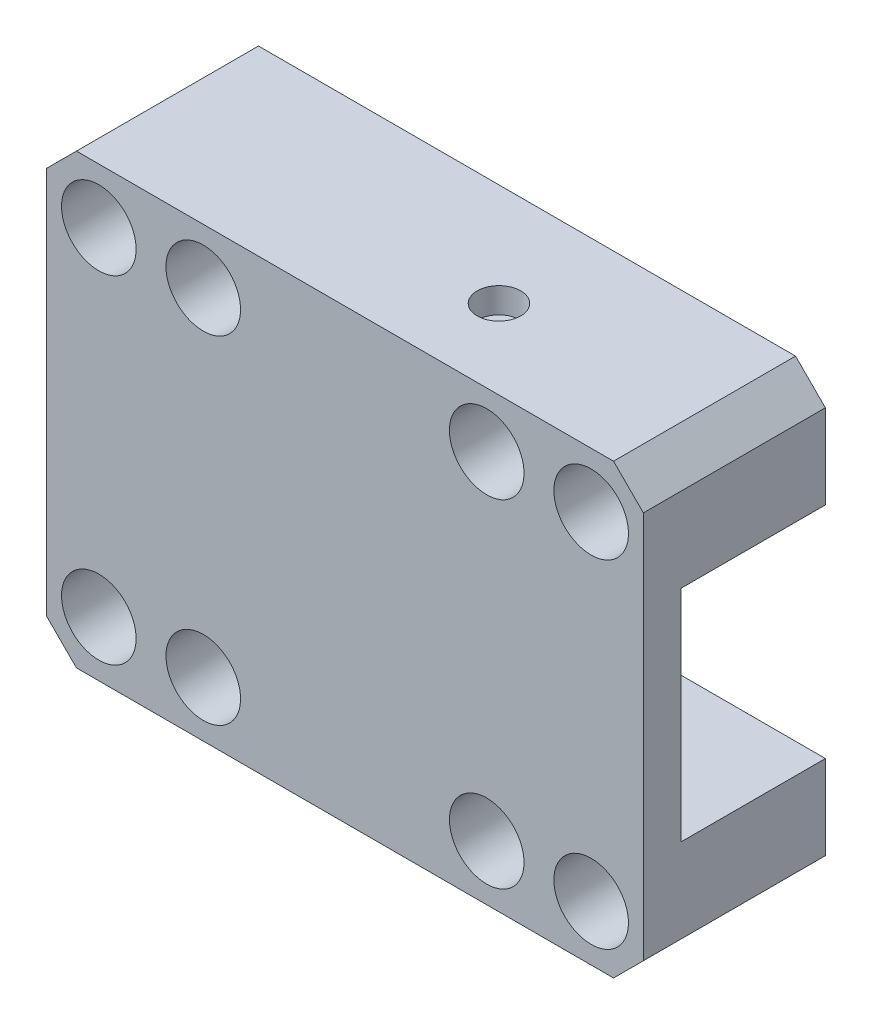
ISO-10303-21;
HEADER;
FILE_DESCRIPTION(('STEP AP214'),'2;1');
FILE_NAME('part.step','',(''),(''),'','','');
FILE_SCHEMA(('AUTOMOTIVE_DESIGN { 1 0 10303 214 1 1 1 1 }'));
ENDSEC;
DATA;
#1=APPLICATION_CONTEXT('core data for automotive mechanical design processes');
#2=APPLICATION_PROTOCOL_DEFINITION('international standard','automotive_design',2000,#1);
#3=PRODUCT_CONTEXT('',#1,'mechanical');
#4=PRODUCT('Part','Part','',(#3));
#5=PRODUCT_RELATED_PRODUCT_CATEGORY('part','',(#4));
#6=PRODUCT_DEFINITION_FORMATION('','',#4);
#7=PRODUCT_DEFINITION_CONTEXT('part definition',#1,'design');
#8=PRODUCT_DEFINITION('design','',#6,#7);
#9=PRODUCT_DEFINITION_SHAPE('','',#8);
#10=(LENGTH_UNIT() NAMED_UNIT(*) SI_UNIT(.MILLI.,.METRE.));
#11=(NAMED_UNIT(*) PLANE_ANGLE_UNIT() SI_UNIT($,.RADIAN.));
#12=(NAMED_UNIT(*) SI_UNIT($,.STERADIAN.) SOLID_ANGLE_UNIT());
#13=UNCERTAINTY_MEASURE_WITH_UNIT(LENGTH_MEASURE(1.E-05),#10,'distance_accuracy_value','');
#14=(GEOMETRIC_REPRESENTATION_CONTEXT(3) GLOBAL_UNCERTAINTY_ASSIGNED_CONTEXT((#13)) GLOBAL_UNIT_ASSIGNED_CONTEXT((#10,
#11,#12)) REPRESENTATION_CONTEXT('',''));
#15=CARTESIAN_POINT('',(0.,0.,0.));
#16=DIRECTION('',(0.,0.,1.));
#17=DIRECTION('',(1.,0.,0.));
#18=AXIS2_PLACEMENT_3D('',#15,#16,#17);
#19=CARTESIAN_POINT('',(21.96,18.3,19.0070999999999));
#20=DIRECTION('',(0.,0.,1.));
#21=DIRECTION('',(1.,0.,0.));
#22=AXIS2_PLACEMENT_3D('',#19,#20,#21);
#23=PLANE('',#22);
#24=DIRECTION('',(1.,0.,0.));
#25=VECTOR('',#24,1.);
#26=CARTESIAN_POINT('',(21.96,8.95279999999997,19.0070999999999));
#27=LINE('',#26,#25);
#28=CARTESIAN_POINT('',(26.7225,8.95279999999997,19.0070999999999));
#29=VERTEX_POINT('',#28);
#30=CARTESIAN_POINT('',(17.1975,8.95279999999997,19.0070999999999));
#31=VERTEX_POINT('',#30);
#32=EDGE_CURVE('E150',#29,#31,#27,.F.);
#33=ORIENTED_EDGE('',*,*,#32,.T.);
#34=DIRECTION('',(0.,1.,0.));
#35=VECTOR('',#34,1.);
#36=CARTESIAN_POINT('',(17.1975,18.3,19.0070999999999));
#37=LINE('',#36,#35);
#38=CARTESIAN_POINT('',(17.1975,27.6472,19.0070999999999));
#39=VERTEX_POINT('',#38);
#40=EDGE_CURVE('E174',#31,#39,#37,.T.);
#41=ORIENTED_EDGE('',*,*,#40,.T.);
#42=DIRECTION('',(1.,0.,0.));
#43=VECTOR('',#42,1.);
#44=CARTESIAN_POINT('',(21.96,27.6472,19.0070999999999));
#45=LINE('',#44,#43);
#46=CARTESIAN_POINT('',(26.7225,27.6472,19.0070999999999));
#47=VERTEX_POINT('',#46);
#48=EDGE_CURVE('E153',#39,#47,#45,.T.);
#49=ORIENTED_EDGE('',*,*,#48,.T.);
#50=DIRECTION('',(0.,1.,0.));
#51=VECTOR('',#50,1.);
#52=CARTESIAN_POINT('',(26.7225,18.3,19.0070999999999));
#53=LINE('',#52,#51);
#54=EDGE_CURVE('E148',#47,#29,#53,.F.);
#55=ORIENTED_EDGE('',*,*,#54,.T.);
#56=EDGE_LOOP('',(#33,#41,#49,#55));
#57=FACE_BOUND('',#56,.T.);
#58=ADVANCED_FACE('F16',(#57),#23,.F.);
#59=CARTESIAN_POINT('',(28.1415518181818,35.191,27.7574));
#60=DIRECTION('',(0.,1.,0.));
#61=DIRECTION('',(0.,0.,1.));
#62=AXIS2_PLACEMENT_3D('',#59,#60,#61);
#63=PLANE('',#62);
#64=CARTESIAN_POINT('',(28.31,35.191,27.7573999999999));
#65=DIRECTION('',(0.,-1.,0.));
#66=DIRECTION('',(0.,0.,-1.));
#67=AXIS2_PLACEMENT_3D('',#64,#65,#66);
#68=CIRCLE('',#67,1.85293);
#69=CARTESIAN_POINT('',(28.31,35.191,25.9044699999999));
#70=VERTEX_POINT('',#69);
#71=EDGE_CURVE('E20',#70,#70,#68,.F.);
#72=ORIENTED_EDGE('',*,*,#71,.T.);
#73=EDGE_LOOP('',(#72));
#74=FACE_BOUND('',#73,.T.);
#75=ADVANCED_FACE('F644',(#74),#63,.T.);
#76=CARTESIAN_POINT('',(26.7225,18.3,25.1665999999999));
#77=DIRECTION('',(-1.,0.,0.));
#78=DIRECTION('',(0.,0.,1.));
#79=AXIS2_PLACEMENT_3D('',#76,#77,#78);
#80=PLANE('',#79);
#81=DIRECTION('',(0.,0.,1.));
#82=VECTOR('',#81,1.);
#83=CARTESIAN_POINT('',(26.7225,8.95279999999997,25.1665999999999));
#84=LINE('',#83,#82);
#85=CARTESIAN_POINT('',(26.7225,8.95279999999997,19.0198));
#86=VERTEX_POINT('',#85);
#87=EDGE_CURVE('E158',#86,#29,#84,.F.);
#88=ORIENTED_EDGE('',*,*,#87,.T.);
#89=ORIENTED_EDGE('',*,*,#54,.F.);
#90=DIRECTION('',(0.,0.,-1.));
#91=VECTOR('',#90,1.);
#92=CARTESIAN_POINT('',(26.7225,27.6472,25.1665999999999));
#93=LINE('',#92,#91);
#94=CARTESIAN_POINT('',(26.7225,27.6472,19.0198));
#95=VERTEX_POINT('',#94);
#96=EDGE_CURVE('E178',#47,#95,#93,.F.);
#97=ORIENTED_EDGE('',*,*,#96,.T.);
#98=DIRECTION('',(0.,0.,-1.));
#99=VECTOR('',#98,1.);
#100=CARTESIAN_POINT('',(26.7225,27.6472,25.1666));
#101=LINE('',#100,#99);
#102=CARTESIAN_POINT('',(26.7225,27.6472,31.3260999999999));
#103=VERTEX_POINT('',#102);
#104=EDGE_CURVE('E188',#103,#95,#101,.T.);
#105=ORIENTED_EDGE('',*,*,#104,.F.);
#106=DIRECTION('',(0.,1.,0.));
#107=VECTOR('',#106,1.);
#108=CARTESIAN_POINT('',(26.7225,18.3,31.3261));
#109=LINE('',#108,#107);
#110=CARTESIAN_POINT('',(26.7225,8.95279999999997,31.3260999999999));
#111=VERTEX_POINT('',#110);
#112=EDGE_CURVE('E184',#111,#103,#109,.T.);
#113=ORIENTED_EDGE('',*,*,#112,.F.);
#114=DIRECTION('',(0.,0.,1.));
#115=VECTOR('',#114,1.);
#116=CARTESIAN_POINT('',(26.7225,8.95279999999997,25.1666));
#117=LINE('',#116,#115);
#118=EDGE_CURVE('E170',#86,#111,#117,.T.);
#119=ORIENTED_EDGE('',*,*,#118,.F.);
#120=EDGE_LOOP('',(#88,#89,#97,#105,#113,#119));
#121=FACE_BOUND('',#120,.T.);
#122=ADVANCED_FACE('F168',(#121),#80,.F.);
#123=CARTESIAN_POINT('',(14.34,2.42499999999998,22.3091));
#124=DIRECTION('',(0.,1.,0.));
#125=DIRECTION('',(0.,0.,1.));
#126=AXIS2_PLACEMENT_3D('',#123,#124,#125);
#127=PLANE('',#126);
#128=CARTESIAN_POINT('',(14.213,2.42499999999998,22.3091));
#129=DIRECTION('',(0.,-1.,0.));
#130=DIRECTION('',(0.,0.,-1.));
#131=AXIS2_PLACEMENT_3D('',#128,#129,#130);
#132=CIRCLE('',#131,1.397);
#133=CARTESIAN_POINT('',(14.213,2.42499999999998,20.9121));
#134=VERTEX_POINT('',#133);
#135=EDGE_CURVE('E193',#134,#134,#132,.T.);
#136=ORIENTED_EDGE('',*,*,#135,.T.);
#137=EDGE_LOOP('',(#136));
#138=FACE_BOUND('',#137,.T.);
#139=ADVANCED_FACE('F350',(#138),#127,.F.);
#140=CARTESIAN_POINT('',(29.58,2.42499999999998,22.3091));
#141=DIRECTION('',(0.,1.,0.));
#142=DIRECTION('',(0.,0.,1.));
#143=AXIS2_PLACEMENT_3D('',#140,#141,#142);
#144=PLANE('',#143);
#145=CARTESIAN_POINT('',(29.707,2.42499999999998,22.3091));
#146=DIRECTION('',(0.,-1.,0.));
#147=DIRECTION('',(0.,0.,-1.));
#148=AXIS2_PLACEMENT_3D('',#145,#146,#147);
#149=CIRCLE('',#148,1.397);
#150=CARTESIAN_POINT('',(29.707,2.42499999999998,20.9121));
#151=VERTEX_POINT('',#150);
#152=EDGE_CURVE('E199',#151,#151,#149,.T.);
#153=ORIENTED_EDGE('',*,*,#152,.T.);
#154=EDGE_LOOP('',(#153));
#155=FACE_BOUND('',#154,.T.);
#156=ADVANCED_FACE('F674',(#155),#144,.F.);
#157=CARTESIAN_POINT('',(21.96,8.95279999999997,25.1665999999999));
#158=DIRECTION('',(0.,1.,0.));
#159=DIRECTION('',(0.,0.,1.));
#160=AXIS2_PLACEMENT_3D('',#157,#158,#159);
#161=PLANE('',#160);
#162=DIRECTION('',(0.,0.,-1.));
#163=VECTOR('',#162,1.);
#164=CARTESIAN_POINT('',(17.1975,8.95279999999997,25.1665999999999));
#165=LINE('',#164,#163);
#166=CARTESIAN_POINT('',(17.1975,8.95279999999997,19.0198));
#167=VERTEX_POINT('',#166);
#168=EDGE_CURVE('E165',#167,#31,#165,.T.);
#169=ORIENTED_EDGE('',*,*,#168,.T.);
#170=ORIENTED_EDGE('',*,*,#32,.F.);
#171=ORIENTED_EDGE('',*,*,#87,.F.);
#172=DIRECTION('',(-1.,0.,0.));
#173=VECTOR('',#172,1.);
#174=CARTESIAN_POINT('',(21.96,8.95279999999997,19.0198));
#175=LINE('',#174,#173);
#176=EDGE_CURVE('E203',#167,#86,#175,.F.);
#177=ORIENTED_EDGE('',*,*,#176,.F.);
#178=EDGE_LOOP('',(#169,#170,#171,#177));
#179=FACE_BOUND('',#178,.T.);
#180=ADVANCED_FACE('F162',(#179),#161,.F.);
#181=CARTESIAN_POINT('',(17.1975,18.3,25.1665999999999));
#182=DIRECTION('',(1.,0.,0.));
#183=DIRECTION('',(0.,0.,-1.));
#184=AXIS2_PLACEMENT_3D('',#181,#182,#183);
#185=PLANE('',#184);
#186=DIRECTION('',(0.,0.,-1.));
#187=VECTOR('',#186,1.);
#188=CARTESIAN_POINT('',(17.1975,27.6472,25.1665999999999));
#189=LINE('',#188,#187);
#190=CARTESIAN_POINT('',(17.1975,27.6472,19.0198));
#191=VERTEX_POINT('',#190);
#192=EDGE_CURVE('E176',#191,#39,#189,.T.);
#193=ORIENTED_EDGE('',*,*,#192,.T.);
#194=ORIENTED_EDGE('',*,*,#40,.F.);
#195=ORIENTED_EDGE('',*,*,#168,.F.);
#196=DIRECTION('',(0.,0.,1.));
#197=VECTOR('',#196,1.);
#198=CARTESIAN_POINT('',(17.1975,8.95279999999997,25.1666));
#199=LINE('',#198,#197);
#200=CARTESIAN_POINT('',(17.1975,8.95279999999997,31.3260999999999));
#201=VERTEX_POINT('',#200);
#202=EDGE_CURVE('E195',#201,#167,#199,.F.);
#203=ORIENTED_EDGE('',*,*,#202,.F.);
#204=DIRECTION('',(0.,1.,0.));
#205=VECTOR('',#204,1.);
#206=CARTESIAN_POINT('',(17.1975,18.3,31.3261));
#207=LINE('',#206,#205);
#208=CARTESIAN_POINT('',(17.1975,27.6472,31.3260999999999));
#209=VERTEX_POINT('',#208);
#210=EDGE_CURVE('E208',#209,#201,#207,.F.);
#211=ORIENTED_EDGE('',*,*,#210,.F.);
#212=DIRECTION('',(0.,0.,-1.));
#213=VECTOR('',#212,1.);
#214=CARTESIAN_POINT('',(17.1975,27.6472,25.1666));
#215=LINE('',#214,#213);
#216=EDGE_CURVE('E202',#191,#209,#215,.F.);
#217=ORIENTED_EDGE('',*,*,#216,.F.);
#218=EDGE_LOOP('',(#193,#194,#195,#203,#211,#217));
#219=FACE_BOUND('',#218,.T.);
#220=ADVANCED_FACE('F408',(#219),#185,.F.);
#221=CARTESIAN_POINT('',(21.96,27.6472,25.1665999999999));
#222=DIRECTION('',(0.,-1.,0.));
#223=DIRECTION('',(0.,0.,-1.));
#224=AXIS2_PLACEMENT_3D('',#221,#222,#223);
#225=PLANE('',#224);
#226=ORIENTED_EDGE('',*,*,#96,.F.);
#227=ORIENTED_EDGE('',*,*,#48,.F.);
#228=ORIENTED_EDGE('',*,*,#192,.F.);
#229=DIRECTION('',(-1.,0.,0.));
#230=VECTOR('',#229,1.);
#231=CARTESIAN_POINT('',(21.96,27.6472,19.0198));
#232=LINE('',#231,#230);
#233=EDGE_CURVE('E219',#95,#191,#232,.T.);
#234=ORIENTED_EDGE('',*,*,#233,.F.);
#235=EDGE_LOOP('',(#226,#227,#228,#234));
#236=FACE_BOUND('',#235,.T.);
#237=ADVANCED_FACE('F411',(#236),#225,.F.);
#238=CARTESIAN_POINT('',(28.31,37.3499999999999,27.7573999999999));
#239=DIRECTION('',(0.,-1.,0.));
#240=DIRECTION('',(0.,0.,-1.));
#241=AXIS2_PLACEMENT_3D('',#238,#239,#240);
#242=CYLINDRICAL_SURFACE('',#241,1.85293);
#243=CARTESIAN_POINT('',(28.31,37.3499999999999,27.7573999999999));
#244=DIRECTION('',(0.,-1.,0.));
#245=DIRECTION('',(0.,0.,-1.));
#246=AXIS2_PLACEMENT_3D('',#243,#244,#245);
#247=CIRCLE('',#246,1.85293);
#248=CARTESIAN_POINT('',(28.31,37.3499999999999,25.9044699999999));
#249=VERTEX_POINT('',#248);
#250=EDGE_CURVE('E225',#249,#249,#247,.T.);
#251=ORIENTED_EDGE('',*,*,#250,.F.);
#252=EDGE_LOOP('',(#251));
#253=FACE_BOUND('',#252,.T.);
#254=ORIENTED_EDGE('',*,*,#71,.F.);
#255=EDGE_LOOP('',(#254));
#256=FACE_BOUND('',#255,.T.);
#257=ADVANCED_FACE('F712',(#253,#256),#242,.F.);
#258=CARTESIAN_POINT('',(21.96,8.95279999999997,25.1666));
#259=DIRECTION('',(0.,1.,0.));
#260=DIRECTION('',(0.,0.,1.));
#261=AXIS2_PLACEMENT_3D('',#258,#259,#260);
#262=PLANE('',#261);
#263=DIRECTION('',(0.,0.,-1.));
#264=VECTOR('',#263,1.);
#265=CARTESIAN_POINT('',(47.36,8.95279999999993,19.0197999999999));
#266=LINE('',#265,#264);
#267=CARTESIAN_POINT('',(47.36,8.95279999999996,19.0198));
#268=VERTEX_POINT('',#267);
#269=CARTESIAN_POINT('',(47.36,8.95279999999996,31.3260999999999));
#270=VERTEX_POINT('',#269);
#271=EDGE_CURVE('E228',#268,#270,#266,.F.);
#272=ORIENTED_EDGE('',*,*,#271,.F.);
#273=DIRECTION('',(-1.,0.,0.));
#274=VECTOR('',#273,1.);
#275=CARTESIAN_POINT('',(21.96,8.95279999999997,19.0198));
#276=LINE('',#275,#274);
#277=EDGE_CURVE('E200',#86,#268,#276,.F.);
#278=ORIENTED_EDGE('',*,*,#277,.F.);
#279=ORIENTED_EDGE('',*,*,#118,.T.);
#280=DIRECTION('',(-1.,0.,0.));
#281=VECTOR('',#280,1.);
#282=CARTESIAN_POINT('',(21.96,8.95279999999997,31.3261));
#283=LINE('',#282,#281);
#284=EDGE_CURVE('E185',#270,#111,#283,.T.);
#285=ORIENTED_EDGE('',*,*,#284,.F.);
#286=EDGE_LOOP('',(#272,#278,#279,#285));
#287=FACE_BOUND('',#286,.T.);
#288=ADVANCED_FACE('F723',(#287),#262,.T.);
#289=CARTESIAN_POINT('',(21.96,18.3,31.3261));
#290=DIRECTION('',(0.,0.,-1.));
#291=DIRECTION('',(-1.,0.,0.));
#292=AXIS2_PLACEMENT_3D('',#289,#290,#291);
#293=PLANE('',#292);
#294=DIRECTION('',(0.,1.,0.));
#295=VECTOR('',#294,1.);
#296=CARTESIAN_POINT('',(47.36,34.8099999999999,31.3261));
#297=LINE('',#296,#295);
#298=CARTESIAN_POINT('',(47.36,27.6472,31.3261));
#299=VERTEX_POINT('',#298);
#300=EDGE_CURVE('E241',#270,#299,#297,.T.);
#301=ORIENTED_EDGE('',*,*,#300,.F.);
#302=ORIENTED_EDGE('',*,*,#284,.T.);
#303=ORIENTED_EDGE('',*,*,#112,.T.);
#304=DIRECTION('',(1.,0.,0.));
#305=VECTOR('',#304,1.);
#306=CARTESIAN_POINT('',(21.96,27.6472,31.3261));
#307=LINE('',#306,#305);
#308=EDGE_CURVE('E190',#299,#103,#307,.F.);
#309=ORIENTED_EDGE('',*,*,#308,.F.);
#310=EDGE_LOOP('',(#301,#302,#303,#309));
#311=FACE_BOUND('',#310,.T.);
#312=ADVANCED_FACE('F735',(#311),#293,.T.);
#313=CARTESIAN_POINT('',(21.96,27.6472,25.1666));
#314=DIRECTION('',(0.,-1.,0.));
#315=DIRECTION('',(0.,0.,-1.));
#316=AXIS2_PLACEMENT_3D('',#313,#314,#315);
#317=PLANE('',#316);
#318=DIRECTION('',(0.,0.,-1.));
#319=VECTOR('',#318,1.);
#320=CARTESIAN_POINT('',(47.36,27.6472,19.0197999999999));
#321=LINE('',#320,#319);
#322=CARTESIAN_POINT('',(47.36,27.6472,19.0198));
#323=VERTEX_POINT('',#322);
#324=EDGE_CURVE('E239',#299,#323,#321,.T.);
#325=ORIENTED_EDGE('',*,*,#324,.F.);
#326=ORIENTED_EDGE('',*,*,#308,.T.);
#327=ORIENTED_EDGE('',*,*,#104,.T.);
#328=DIRECTION('',(-1.,0.,0.));
#329=VECTOR('',#328,1.);
#330=CARTESIAN_POINT('',(21.96,27.6472,19.0198));
#331=LINE('',#330,#329);
#332=EDGE_CURVE('E212',#323,#95,#331,.T.);
#333=ORIENTED_EDGE('',*,*,#332,.F.);
#334=EDGE_LOOP('',(#325,#326,#327,#333));
#335=FACE_BOUND('',#334,.T.);
#336=ADVANCED_FACE('F356',(#335),#317,.T.);
#337=CARTESIAN_POINT('',(14.213,2.42499999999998,22.3091));
#338=DIRECTION('',(0.,-1.,0.));
#339=DIRECTION('',(0.,0.,-1.));
#340=AXIS2_PLACEMENT_3D('',#337,#338,#339);
#341=CYLINDRICAL_SURFACE('',#340,1.397);
#342=ORIENTED_EDGE('',*,*,#135,.F.);
#343=EDGE_LOOP('',(#342));
#344=FACE_BOUND('',#343,.T.);
#345=CARTESIAN_POINT('',(14.213,-0.750000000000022,22.3091));
#346=DIRECTION('',(0.,-1.,0.));
#347=DIRECTION('',(0.,0.,-1.));
#348=AXIS2_PLACEMENT_3D('',#345,#346,#347);
#349=CIRCLE('',#348,1.397);
#350=CARTESIAN_POINT('',(14.213,-0.750000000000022,20.9121));
#351=VERTEX_POINT('',#350);
#352=EDGE_CURVE('E250',#351,#351,#349,.F.);
#353=ORIENTED_EDGE('',*,*,#352,.F.);
#354=EDGE_LOOP('',(#353));
#355=FACE_BOUND('',#354,.T.);
#356=ADVANCED_FACE('F352',(#344,#355),#341,.F.);
#357=CARTESIAN_POINT('',(29.707,2.42499999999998,22.3091));
#358=DIRECTION('',(0.,-1.,0.));
#359=DIRECTION('',(0.,0.,-1.));
#360=AXIS2_PLACEMENT_3D('',#357,#358,#359);
#361=CYLINDRICAL_SURFACE('',#360,1.397);
#362=ORIENTED_EDGE('',*,*,#152,.F.);
#363=EDGE_LOOP('',(#362));
#364=FACE_BOUND('',#363,.T.);
#365=CARTESIAN_POINT('',(29.707,-0.750000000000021,22.3091));
#366=DIRECTION('',(0.,-1.,0.));
#367=DIRECTION('',(0.,0.,-1.));
#368=AXIS2_PLACEMENT_3D('',#365,#366,#367);
#369=CIRCLE('',#368,1.397);
#370=CARTESIAN_POINT('',(29.707,-0.750000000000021,20.9121));
#371=VERTEX_POINT('',#370);
#372=EDGE_CURVE('E257',#371,#371,#369,.F.);
#373=ORIENTED_EDGE('',*,*,#372,.F.);
#374=EDGE_LOOP('',(#373));
#375=FACE_BOUND('',#374,.T.);
#376=ADVANCED_FACE('F355',(#364,#375),#361,.F.);
#377=CARTESIAN_POINT('',(21.96,8.95279999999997,25.1666));
#378=DIRECTION('',(0.,1.,0.));
#379=DIRECTION('',(0.,0.,1.));
#380=AXIS2_PLACEMENT_3D('',#377,#378,#379);
#381=PLANE('',#380);
#382=DIRECTION('',(0.,0.,1.));
#383=VECTOR('',#382,1.);
#384=CARTESIAN_POINT('',(-3.44000000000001,8.95279999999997,19.0198));
#385=LINE('',#384,#383);
#386=CARTESIAN_POINT('',(-3.44000000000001,8.95279999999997,31.3261));
#387=VERTEX_POINT('',#386);
#388=CARTESIAN_POINT('',(-3.44000000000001,8.95279999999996,19.0198));
#389=VERTEX_POINT('',#388);
#390=EDGE_CURVE('E254',#387,#389,#385,.F.);
#391=ORIENTED_EDGE('',*,*,#390,.F.);
#392=DIRECTION('',(-1.,0.,0.));
#393=VECTOR('',#392,1.);
#394=CARTESIAN_POINT('',(21.96,8.95279999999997,31.3261));
#395=LINE('',#394,#393);
#396=EDGE_CURVE('E213',#201,#387,#395,.T.);
#397=ORIENTED_EDGE('',*,*,#396,.F.);
#398=ORIENTED_EDGE('',*,*,#202,.T.);
#399=DIRECTION('',(-1.,0.,0.));
#400=VECTOR('',#399,1.);
#401=CARTESIAN_POINT('',(21.96,8.95279999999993,19.0198));
#402=LINE('',#401,#400);
#403=EDGE_CURVE('E198',#389,#167,#402,.F.);
#404=ORIENTED_EDGE('',*,*,#403,.F.);
#405=EDGE_LOOP('',(#391,#397,#398,#404));
#406=FACE_BOUND('',#405,.T.);
#407=ADVANCED_FACE('F403',(#406),#381,.T.);
#408=CARTESIAN_POINT('',(21.96,18.2999999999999,19.0198));
#409=DIRECTION('',(0.,0.,-1.));
#410=DIRECTION('',(-1.,0.,0.));
#411=AXIS2_PLACEMENT_3D('',#408,#409,#410);
#412=PLANE('',#411);
#413=DIRECTION('',(0.707106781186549,-0.707106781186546,0.));
#414=VECTOR('',#413,1.);
#415=CARTESIAN_POINT('',(-0.900000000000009,-0.750000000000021,19.0198));
#416=LINE('',#415,#414);
#417=CARTESIAN_POINT('',(-3.44000000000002,1.78999999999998,19.0198));
#418=VERTEX_POINT('',#417);
#419=CARTESIAN_POINT('',(-0.900000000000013,-0.75000000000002,19.0198));
#420=VERTEX_POINT('',#419);
#421=EDGE_CURVE('E255',#418,#420,#416,.T.);
#422=ORIENTED_EDGE('',*,*,#421,.F.);
#423=DIRECTION('',(0.,1.,0.));
#424=VECTOR('',#423,1.);
#425=CARTESIAN_POINT('',(-3.44000000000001,1.78999999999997,19.0198));
#426=LINE('',#425,#424);
#427=EDGE_CURVE('E269',#389,#418,#426,.F.);
#428=ORIENTED_EDGE('',*,*,#427,.F.);
#429=ORIENTED_EDGE('',*,*,#403,.T.);
#430=ORIENTED_EDGE('',*,*,#176,.T.);
#431=ORIENTED_EDGE('',*,*,#277,.T.);
#432=DIRECTION('',(0.,1.,0.));
#433=VECTOR('',#432,1.);
#434=CARTESIAN_POINT('',(47.36,34.8099999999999,19.0198));
#435=LINE('',#434,#433);
#436=CARTESIAN_POINT('',(47.36,1.78999999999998,19.0198));
#437=VERTEX_POINT('',#436);
#438=EDGE_CURVE('E231',#437,#268,#435,.T.);
#439=ORIENTED_EDGE('',*,*,#438,.F.);
#440=DIRECTION('',(0.707106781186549,0.707106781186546,0.));
#441=VECTOR('',#440,1.);
#442=CARTESIAN_POINT('',(47.36,1.78999999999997,19.0198));
#443=LINE('',#442,#441);
#444=CARTESIAN_POINT('',(44.82,-0.75000000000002,19.0198));
#445=VERTEX_POINT('',#444);
#446=EDGE_CURVE('E234',#445,#437,#443,.T.);
#447=ORIENTED_EDGE('',*,*,#446,.F.);
#448=DIRECTION('',(1.,0.,0.));
#449=VECTOR('',#448,1.);
#450=CARTESIAN_POINT('',(44.82,-0.750000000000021,19.0198));
#451=LINE('',#450,#449);
#452=EDGE_CURVE('E246',#420,#445,#451,.T.);
#453=ORIENTED_EDGE('',*,*,#452,.F.);
#454=EDGE_LOOP('',(#422,#428,#429,#430,#431,#439,#447,#453));
#455=FACE_BOUND('',#454,.T.);
#456=ADVANCED_FACE('F375',(#455),#412,.T.);
#457=CARTESIAN_POINT('',(21.96,27.6472,25.1666));
#458=DIRECTION('',(0.,-1.,0.));
#459=DIRECTION('',(0.,0.,-1.));
#460=AXIS2_PLACEMENT_3D('',#457,#458,#459);
#461=PLANE('',#460);
#462=DIRECTION('',(0.,0.,1.));
#463=VECTOR('',#462,1.);
#464=CARTESIAN_POINT('',(-3.44000000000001,27.6472,19.0198));
#465=LINE('',#464,#463);
#466=CARTESIAN_POINT('',(-3.44000000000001,27.6472,19.0197999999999));
#467=VERTEX_POINT('',#466);
#468=CARTESIAN_POINT('',(-3.44000000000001,27.6472,31.3260999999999));
#469=VERTEX_POINT('',#468);
#470=EDGE_CURVE('E262',#467,#469,#465,.T.);
#471=ORIENTED_EDGE('',*,*,#470,.F.);
#472=DIRECTION('',(-1.,0.,0.));
#473=VECTOR('',#472,1.);
#474=CARTESIAN_POINT('',(21.96,27.6472,19.0198));
#475=LINE('',#474,#473);
#476=EDGE_CURVE('E216',#191,#467,#475,.T.);
#477=ORIENTED_EDGE('',*,*,#476,.F.);
#478=ORIENTED_EDGE('',*,*,#216,.T.);
#479=DIRECTION('',(-1.,0.,0.));
#480=VECTOR('',#479,1.);
#481=CARTESIAN_POINT('',(21.96,27.6472,31.3261));
#482=LINE('',#481,#480);
#483=EDGE_CURVE('E209',#469,#209,#482,.F.);
#484=ORIENTED_EDGE('',*,*,#483,.F.);
#485=EDGE_LOOP('',(#471,#477,#478,#484));
#486=FACE_BOUND('',#485,.T.);
#487=ADVANCED_FACE('F424',(#486),#461,.T.);
#488=CARTESIAN_POINT('',(21.96,18.3,31.3261));
#489=DIRECTION('',(0.,0.,-1.));
#490=DIRECTION('',(-1.,0.,0.));
#491=AXIS2_PLACEMENT_3D('',#488,#489,#490);
#492=PLANE('',#491);
#493=DIRECTION('',(0.,1.,0.));
#494=VECTOR('',#493,1.);
#495=CARTESIAN_POINT('',(-3.44000000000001,1.78999999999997,31.3261));
#496=LINE('',#495,#494);
#497=EDGE_CURVE('E258',#469,#387,#496,.F.);
#498=ORIENTED_EDGE('',*,*,#497,.F.);
#499=ORIENTED_EDGE('',*,*,#483,.T.);
#500=ORIENTED_EDGE('',*,*,#210,.T.);
#501=ORIENTED_EDGE('',*,*,#396,.T.);
#502=EDGE_LOOP('',(#498,#499,#500,#501));
#503=FACE_BOUND('',#502,.T.);
#504=ADVANCED_FACE('F427',(#503),#492,.T.);
#505=CARTESIAN_POINT('',(21.96,18.2999999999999,19.0198));
#506=DIRECTION('',(0.,0.,-1.));
#507=DIRECTION('',(-1.,0.,0.));
#508=AXIS2_PLACEMENT_3D('',#505,#506,#507);
#509=PLANE('',#508);
#510=DIRECTION('',(-0.707106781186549,0.707106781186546,0.));
#511=VECTOR('',#510,1.);
#512=CARTESIAN_POINT('',(44.82,37.35,19.0197999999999));
#513=LINE('',#512,#511);
#514=CARTESIAN_POINT('',(47.36,34.81,19.0197999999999));
#515=VERTEX_POINT('',#514);
#516=CARTESIAN_POINT('',(44.82,37.35,19.0197999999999));
#517=VERTEX_POINT('',#516);
#518=EDGE_CURVE('E229',#515,#517,#513,.T.);
#519=ORIENTED_EDGE('',*,*,#518,.F.);
#520=DIRECTION('',(0.,1.,0.));
#521=VECTOR('',#520,1.);
#522=CARTESIAN_POINT('',(47.36,34.8099999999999,19.0198));
#523=LINE('',#522,#521);
#524=EDGE_CURVE('E237',#323,#515,#523,.T.);
#525=ORIENTED_EDGE('',*,*,#524,.F.);
#526=ORIENTED_EDGE('',*,*,#332,.T.);
#527=ORIENTED_EDGE('',*,*,#233,.T.);
#528=ORIENTED_EDGE('',*,*,#476,.T.);
#529=DIRECTION('',(0.,1.,0.));
#530=VECTOR('',#529,1.);
#531=CARTESIAN_POINT('',(-3.44000000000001,1.78999999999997,19.0197999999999));
#532=LINE('',#531,#530);
#533=CARTESIAN_POINT('',(-3.44000000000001,34.81,19.0197999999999));
#534=VERTEX_POINT('',#533);
#535=EDGE_CURVE('E264',#534,#467,#532,.F.);
#536=ORIENTED_EDGE('',*,*,#535,.F.);
#537=DIRECTION('',(-0.707106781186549,-0.707106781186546,0.));
#538=VECTOR('',#537,1.);
#539=CARTESIAN_POINT('',(-3.44000000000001,34.8099999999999,19.0198));
#540=LINE('',#539,#538);
#541=CARTESIAN_POINT('',(-0.900000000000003,37.35,19.0198));
#542=VERTEX_POINT('',#541);
#543=EDGE_CURVE('E65',#542,#534,#540,.T.);
#544=ORIENTED_EDGE('',*,*,#543,.F.);
#545=DIRECTION('',(1.,0.,0.));
#546=VECTOR('',#545,1.);
#547=CARTESIAN_POINT('',(-0.900000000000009,37.35,19.0198));
#548=LINE('',#547,#546);
#549=EDGE_CURVE('E218',#517,#542,#548,.F.);
#550=ORIENTED_EDGE('',*,*,#549,.F.);
#551=EDGE_LOOP('',(#519,#525,#526,#527,#528,#536,#544,#550));
#552=FACE_BOUND('',#551,.T.);
#553=ADVANCED_FACE('F419',(#552),#509,.T.);
#554=CARTESIAN_POINT('',(9.60636363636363,3.94899999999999,29.4338));
#555=DIRECTION('',(0.,0.,-1.));
#556=DIRECTION('',(-1.,0.,0.));
#557=AXIS2_PLACEMENT_3D('',#554,#555,#556);
#558=PLANE('',#557);
#559=CARTESIAN_POINT('',(9.895,3.94899999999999,29.4338));
#560=DIRECTION('',(0.,0.,-1.));
#561=DIRECTION('',(0.,1.,0.));
#562=AXIS2_PLACEMENT_3D('',#559,#560,#561);
#563=CIRCLE('',#562,3.175);
#564=CARTESIAN_POINT('',(9.895,7.124,29.4338));
#565=VERTEX_POINT('',#564);
#566=EDGE_CURVE('E273',#565,#565,#563,.F.);
#567=ORIENTED_EDGE('',*,*,#566,.T.);
#568=EDGE_LOOP('',(#567));
#569=FACE_BOUND('',#568,.T.);
#570=ADVANCED_FACE('F435',(#569),#558,.F.);
#571=CARTESIAN_POINT('',(42.6263636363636,3.94899999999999,29.4338));
#572=DIRECTION('',(0.,0.,-1.));
#573=DIRECTION('',(-1.,0.,0.));
#574=AXIS2_PLACEMENT_3D('',#571,#572,#573);
#575=PLANE('',#574);
#576=CARTESIAN_POINT('',(42.915,3.94899999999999,29.4338));
#577=DIRECTION('',(0.,0.,-1.));
#578=DIRECTION('',(0.,1.,0.));
#579=AXIS2_PLACEMENT_3D('',#576,#577,#578);
#580=CIRCLE('',#579,3.175);
#581=CARTESIAN_POINT('',(42.915,7.12399999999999,29.4338));
#582=VERTEX_POINT('',#581);
#583=EDGE_CURVE('E335',#582,#582,#580,.F.);
#584=ORIENTED_EDGE('',*,*,#583,.T.);
#585=EDGE_LOOP('',(#584));
#586=FACE_BOUND('',#585,.T.);
#587=ADVANCED_FACE('F797',(#586),#575,.F.);
#588=CARTESIAN_POINT('',(42.6263636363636,32.651,29.4338));
#589=DIRECTION('',(0.,0.,-1.));
#590=DIRECTION('',(-1.,0.,0.));
#591=AXIS2_PLACEMENT_3D('',#588,#589,#590);
#592=PLANE('',#591);
#593=CARTESIAN_POINT('',(42.915,32.651,29.4338));
#594=DIRECTION('',(0.,0.,-1.));
#595=DIRECTION('',(-1.,0.,0.));
#596=AXIS2_PLACEMENT_3D('',#593,#594,#595);
#597=CIRCLE('',#596,3.175);
#598=CARTESIAN_POINT('',(39.74,32.651,29.4338));
#599=VERTEX_POINT('',#598);
#600=EDGE_CURVE('E332',#599,#599,#597,.F.);
#601=ORIENTED_EDGE('',*,*,#600,.T.);
#602=EDGE_LOOP('',(#601));
#603=FACE_BOUND('',#602,.T.);
#604=ADVANCED_FACE('F809',(#603),#592,.F.);
#605=CARTESIAN_POINT('',(0.716363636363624,32.651,29.4338));
#606=DIRECTION('',(0.,0.,-1.));
#607=DIRECTION('',(-1.,0.,0.));
#608=AXIS2_PLACEMENT_3D('',#605,#606,#607);
#609=PLANE('',#608);
#610=CARTESIAN_POINT('',(1.005,32.651,29.4338));
#611=DIRECTION('',(0.,0.,-1.));
#612=DIRECTION('',(-1.,0.,0.));
#613=AXIS2_PLACEMENT_3D('',#610,#611,#612);
#614=CIRCLE('',#613,3.175);
#615=CARTESIAN_POINT('',(-2.17000000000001,32.651,29.4338));
#616=VERTEX_POINT('',#615);
#617=EDGE_CURVE('E329',#616,#616,#614,.F.);
#618=ORIENTED_EDGE('',*,*,#617,.T.);
#619=EDGE_LOOP('',(#618));
#620=FACE_BOUND('',#619,.T.);
#621=ADVANCED_FACE('F820',(#620),#609,.F.);
#622=CARTESIAN_POINT('',(9.60636363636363,32.651,29.4338));
#623=DIRECTION('',(0.,0.,-1.));
#624=DIRECTION('',(-1.,0.,0.));
#625=AXIS2_PLACEMENT_3D('',#622,#623,#624);
#626=PLANE('',#625);
#627=CARTESIAN_POINT('',(9.895,32.651,29.4338));
#628=DIRECTION('',(0.,0.,-1.));
#629=DIRECTION('',(-1.,0.,0.));
#630=AXIS2_PLACEMENT_3D('',#627,#628,#629);
#631=CIRCLE('',#630,3.175);
#632=CARTESIAN_POINT('',(6.72,32.651,29.4338));
#633=VERTEX_POINT('',#632);
#634=EDGE_CURVE('E326',#633,#633,#631,.F.);
#635=ORIENTED_EDGE('',*,*,#634,.T.);
#636=EDGE_LOOP('',(#635));
#637=FACE_BOUND('',#636,.T.);
#638=ADVANCED_FACE('F515',(#637),#626,.F.);
#639=CARTESIAN_POINT('',(33.7363636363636,32.651,29.4338));
#640=DIRECTION('',(0.,0.,-1.));
#641=DIRECTION('',(-1.,0.,0.));
#642=AXIS2_PLACEMENT_3D('',#639,#640,#641);
#643=PLANE('',#642);
#644=CARTESIAN_POINT('',(34.025,32.651,29.4338));
#645=DIRECTION('',(0.,0.,-1.));
#646=DIRECTION('',(-1.,0.,0.));
#647=AXIS2_PLACEMENT_3D('',#644,#645,#646);
#648=CIRCLE('',#647,3.175);
#649=CARTESIAN_POINT('',(30.85,32.651,29.4338));
#650=VERTEX_POINT('',#649);
#651=EDGE_CURVE('E323',#650,#650,#648,.F.);
#652=ORIENTED_EDGE('',*,*,#651,.T.);
#653=EDGE_LOOP('',(#652));
#654=FACE_BOUND('',#653,.T.);
#655=ADVANCED_FACE('F507',(#654),#643,.F.);
#656=CARTESIAN_POINT('',(33.7363636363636,3.94899999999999,29.4338));
#657=DIRECTION('',(0.,0.,-1.));
#658=DIRECTION('',(-1.,0.,0.));
#659=AXIS2_PLACEMENT_3D('',#656,#657,#658);
#660=PLANE('',#659);
#661=CARTESIAN_POINT('',(34.025,3.94899999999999,29.4338));
#662=DIRECTION('',(0.,0.,-1.));
#663=DIRECTION('',(0.,1.,0.));
#664=AXIS2_PLACEMENT_3D('',#661,#662,#663);
#665=CIRCLE('',#664,3.175);
#666=CARTESIAN_POINT('',(34.025,7.124,29.4338));
#667=VERTEX_POINT('',#666);
#668=EDGE_CURVE('E297',#667,#667,#665,.F.);
#669=ORIENTED_EDGE('',*,*,#668,.T.);
#670=EDGE_LOOP('',(#669));
#671=FACE_BOUND('',#670,.T.);
#672=ADVANCED_FACE('F505',(#671),#660,.F.);
#673=CARTESIAN_POINT('',(-0.900000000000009,37.35,19.0198));
#674=DIRECTION('',(0.,1.,0.));
#675=DIRECTION('',(0.,0.,1.));
#676=AXIS2_PLACEMENT_3D('',#673,#674,#675);
#677=PLANE('',#676);
#678=ORIENTED_EDGE('',*,*,#250,.T.);
#679=EDGE_LOOP('',(#678));
#680=FACE_BOUND('',#679,.T.);
#681=ORIENTED_EDGE('',*,*,#549,.T.);
#682=DIRECTION('',(0.,0.,1.));
#683=VECTOR('',#682,1.);
#684=CARTESIAN_POINT('',(-0.899999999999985,37.35,19.0197999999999));
#685=LINE('',#684,#683);
#686=CARTESIAN_POINT('',(-0.900000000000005,37.35,34.5138));
#687=VERTEX_POINT('',#686);
#688=EDGE_CURVE('E261',#687,#542,#685,.F.);
#689=ORIENTED_EDGE('',*,*,#688,.F.);
#690=DIRECTION('',(-1.,0.,0.));
#691=VECTOR('',#690,1.);
#692=CARTESIAN_POINT('',(21.96,37.35,34.5137999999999));
#693=LINE('',#692,#691);
#694=CARTESIAN_POINT('',(44.82,37.35,34.5138));
#695=VERTEX_POINT('',#694);
#696=EDGE_CURVE('E60',#687,#695,#693,.F.);
#697=ORIENTED_EDGE('',*,*,#696,.T.);
#698=DIRECTION('',(0.,0.,1.));
#699=VECTOR('',#698,1.);
#700=CARTESIAN_POINT('',(44.82,37.35,19.0198));
#701=LINE('',#700,#699);
#702=EDGE_CURVE('E226',#517,#695,#701,.T.);
#703=ORIENTED_EDGE('',*,*,#702,.F.);
#704=EDGE_LOOP('',(#681,#689,#697,#703));
#705=FACE_BOUND('',#704,.T.);
#706=ADVANCED_FACE('F393',(#680,#705),#677,.T.);
#707=CARTESIAN_POINT('',(44.82,37.35,19.0198));
#708=DIRECTION('',(0.707106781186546,0.707106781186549,0.));
#709=DIRECTION('',(-0.707106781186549,0.707106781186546,0.));
#710=AXIS2_PLACEMENT_3D('',#707,#708,#709);
#711=PLANE('',#710);
#712=ORIENTED_EDGE('',*,*,#518,.T.);
#713=ORIENTED_EDGE('',*,*,#702,.T.);
#714=DIRECTION('',(0.707106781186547,-0.707106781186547,0.));
#715=VECTOR('',#714,1.);
#716=CARTESIAN_POINT('',(44.82,37.35,34.5137999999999));
#717=LINE('',#716,#715);
#718=CARTESIAN_POINT('',(47.36,34.81,34.5138));
#719=VERTEX_POINT('',#718);
#720=EDGE_CURVE('E294',#695,#719,#717,.T.);
#721=ORIENTED_EDGE('',*,*,#720,.T.);
#722=DIRECTION('',(0.,0.,-1.));
#723=VECTOR('',#722,1.);
#724=CARTESIAN_POINT('',(47.36,34.8099999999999,19.0197999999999));
#725=LINE('',#724,#723);
#726=EDGE_CURVE('E235',#515,#719,#725,.F.);
#727=ORIENTED_EDGE('',*,*,#726,.F.);
#728=EDGE_LOOP('',(#712,#713,#721,#727));
#729=FACE_BOUND('',#728,.T.);
#730=ADVANCED_FACE('F389',(#729),#711,.T.);
#731=CARTESIAN_POINT('',(47.36,34.8099999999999,19.0197999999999));
#732=DIRECTION('',(1.,0.,0.));
#733=DIRECTION('',(0.,0.,-1.));
#734=AXIS2_PLACEMENT_3D('',#731,#732,#733);
#735=PLANE('',#734);
#736=DIRECTION('',(0.,0.,1.));
#737=VECTOR('',#736,1.);
#738=CARTESIAN_POINT('',(47.36,1.78999999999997,19.0198));
#739=LINE('',#738,#737);
#740=CARTESIAN_POINT('',(47.36,1.79,34.5138));
#741=VERTEX_POINT('',#740);
#742=EDGE_CURVE('E244',#437,#741,#739,.T.);
#743=ORIENTED_EDGE('',*,*,#742,.F.);
#744=ORIENTED_EDGE('',*,*,#438,.T.);
#745=ORIENTED_EDGE('',*,*,#271,.T.);
#746=ORIENTED_EDGE('',*,*,#300,.T.);
#747=ORIENTED_EDGE('',*,*,#324,.T.);
#748=ORIENTED_EDGE('',*,*,#524,.T.);
#749=ORIENTED_EDGE('',*,*,#726,.T.);
#750=DIRECTION('',(0.,1.,0.));
#751=VECTOR('',#750,1.);
#752=CARTESIAN_POINT('',(47.36,18.3,34.5137999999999));
#753=LINE('',#752,#751);
#754=EDGE_CURVE('E291',#719,#741,#753,.F.);
#755=ORIENTED_EDGE('',*,*,#754,.T.);
#756=EDGE_LOOP('',(#743,#744,#745,#746,#747,#748,#749,#755));
#757=FACE_BOUND('',#756,.T.);
#758=ADVANCED_FACE('F384',(#757),#735,.T.);
#759=CARTESIAN_POINT('',(47.36,1.78999999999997,19.0198));
#760=DIRECTION('',(0.707106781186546,-0.707106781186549,0.));
#761=DIRECTION('',(0.707106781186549,0.707106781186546,0.));
#762=AXIS2_PLACEMENT_3D('',#759,#760,#761);
#763=PLANE('',#762);
#764=ORIENTED_EDGE('',*,*,#446,.T.);
#765=ORIENTED_EDGE('',*,*,#742,.T.);
#766=DIRECTION('',(-0.707106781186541,-0.707106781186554,0.));
#767=VECTOR('',#766,1.);
#768=CARTESIAN_POINT('',(47.36,1.79000000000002,34.5137999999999));
#769=LINE('',#768,#767);
#770=CARTESIAN_POINT('',(44.82,-0.75000000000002,34.5138));
#771=VERTEX_POINT('',#770);
#772=EDGE_CURVE('E288',#741,#771,#769,.T.);
#773=ORIENTED_EDGE('',*,*,#772,.T.);
#774=DIRECTION('',(0.,0.,-1.));
#775=VECTOR('',#774,1.);
#776=CARTESIAN_POINT('',(44.82,-0.750000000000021,19.0198));
#777=LINE('',#776,#775);
#778=EDGE_CURVE('E248',#445,#771,#777,.F.);
#779=ORIENTED_EDGE('',*,*,#778,.F.);
#780=EDGE_LOOP('',(#764,#765,#773,#779));
#781=FACE_BOUND('',#780,.T.);
#782=ADVANCED_FACE('F364',(#781),#763,.T.);
#783=CARTESIAN_POINT('',(44.82,-0.750000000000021,19.0198));
#784=DIRECTION('',(0.,-1.,0.));
#785=DIRECTION('',(0.,0.,-1.));
#786=AXIS2_PLACEMENT_3D('',#783,#784,#785);
#787=PLANE('',#786);
#788=ORIENTED_EDGE('',*,*,#372,.T.);
#789=EDGE_LOOP('',(#788));
#790=FACE_BOUND('',#789,.T.);
#791=ORIENTED_EDGE('',*,*,#352,.T.);
#792=EDGE_LOOP('',(#791));
#793=FACE_BOUND('',#792,.T.);
#794=ORIENTED_EDGE('',*,*,#452,.T.);
#795=ORIENTED_EDGE('',*,*,#778,.T.);
#796=DIRECTION('',(-1.,0.,0.));
#797=VECTOR('',#796,1.);
#798=CARTESIAN_POINT('',(21.96,-0.750000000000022,34.5137999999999));
#799=LINE('',#798,#797);
#800=CARTESIAN_POINT('',(-0.900000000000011,-0.750000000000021,34.5137999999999));
#801=VERTEX_POINT('',#800);
#802=EDGE_CURVE('E285',#771,#801,#799,.T.);
#803=ORIENTED_EDGE('',*,*,#802,.T.);
#804=DIRECTION('',(0.,0.,1.));
#805=VECTOR('',#804,1.);
#806=CARTESIAN_POINT('',(-0.900000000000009,-0.750000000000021,19.0198));
#807=LINE('',#806,#805);
#808=EDGE_CURVE('E252',#420,#801,#807,.T.);
#809=ORIENTED_EDGE('',*,*,#808,.F.);
#810=EDGE_LOOP('',(#794,#795,#803,#809));
#811=FACE_BOUND('',#810,.T.);
#812=ADVANCED_FACE('F360',(#790,#793,#811),#787,.T.);
#813=CARTESIAN_POINT('',(-0.900000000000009,-0.750000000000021,19.0198));
#814=DIRECTION('',(-0.707106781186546,-0.707106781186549,0.));
#815=DIRECTION('',(0.707106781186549,-0.707106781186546,0.));
#816=AXIS2_PLACEMENT_3D('',#813,#814,#815);
#817=PLANE('',#816);
#818=ORIENTED_EDGE('',*,*,#421,.T.);
#819=ORIENTED_EDGE('',*,*,#808,.T.);
#820=DIRECTION('',(-0.707106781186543,0.707106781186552,0.));
#821=VECTOR('',#820,1.);
#822=CARTESIAN_POINT('',(-0.900000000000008,-0.750000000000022,34.5137999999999));
#823=LINE('',#822,#821);
#824=CARTESIAN_POINT('',(-3.44000000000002,1.78999999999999,34.5138));
#825=VERTEX_POINT('',#824);
#826=EDGE_CURVE('E282',#801,#825,#823,.T.);
#827=ORIENTED_EDGE('',*,*,#826,.T.);
#828=DIRECTION('',(0.,0.,1.));
#829=VECTOR('',#828,1.);
#830=CARTESIAN_POINT('',(-3.44000000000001,1.78999999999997,19.0198));
#831=LINE('',#830,#829);
#832=EDGE_CURVE('E267',#418,#825,#831,.T.);
#833=ORIENTED_EDGE('',*,*,#832,.F.);
#834=EDGE_LOOP('',(#818,#819,#827,#833));
#835=FACE_BOUND('',#834,.T.);
#836=ADVANCED_FACE('F363',(#835),#817,.T.);
#837=CARTESIAN_POINT('',(-3.44000000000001,1.78999999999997,19.0198));
#838=DIRECTION('',(-1.,0.,0.));
#839=DIRECTION('',(0.,0.,1.));
#840=AXIS2_PLACEMENT_3D('',#837,#838,#839);
#841=PLANE('',#840);
#842=ORIENTED_EDGE('',*,*,#470,.T.);
#843=ORIENTED_EDGE('',*,*,#497,.T.);
#844=ORIENTED_EDGE('',*,*,#390,.T.);
#845=ORIENTED_EDGE('',*,*,#427,.T.);
#846=ORIENTED_EDGE('',*,*,#832,.T.);
#847=DIRECTION('',(0.,1.,0.));
#848=VECTOR('',#847,1.);
#849=CARTESIAN_POINT('',(-3.44000000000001,18.3,34.5137999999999));
#850=LINE('',#849,#848);
#851=CARTESIAN_POINT('',(-3.44000000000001,34.81,34.5138));
#852=VERTEX_POINT('',#851);
#853=EDGE_CURVE('E279',#825,#852,#850,.T.);
#854=ORIENTED_EDGE('',*,*,#853,.T.);
#855=DIRECTION('',(0.,0.,1.));
#856=VECTOR('',#855,1.);
#857=CARTESIAN_POINT('',(-3.44000000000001,34.8099999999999,19.0197999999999));
#858=LINE('',#857,#856);
#859=EDGE_CURVE('E35',#534,#852,#858,.T.);
#860=ORIENTED_EDGE('',*,*,#859,.F.);
#861=ORIENTED_EDGE('',*,*,#535,.T.);
#862=EDGE_LOOP('',(#842,#843,#844,#845,#846,#854,#860,#861));
#863=FACE_BOUND('',#862,.T.);
#864=ADVANCED_FACE('F396',(#863),#841,.T.);
#865=CARTESIAN_POINT('',(-3.44000000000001,34.8099999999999,19.0197999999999));
#866=DIRECTION('',(-0.707106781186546,0.707106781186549,0.));
#867=DIRECTION('',(-0.707106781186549,-0.707106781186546,0.));
#868=AXIS2_PLACEMENT_3D('',#865,#866,#867);
#869=PLANE('',#868);
#870=ORIENTED_EDGE('',*,*,#543,.T.);
#871=ORIENTED_EDGE('',*,*,#859,.T.);
#872=DIRECTION('',(0.707106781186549,0.707106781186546,0.));
#873=VECTOR('',#872,1.);
#874=CARTESIAN_POINT('',(-3.44000000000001,34.81,34.5137999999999));
#875=LINE('',#874,#873);
#876=EDGE_CURVE('E276',#852,#687,#875,.T.);
#877=ORIENTED_EDGE('',*,*,#876,.T.);
#878=ORIENTED_EDGE('',*,*,#688,.T.);
#879=EDGE_LOOP('',(#870,#871,#877,#878));
#880=FACE_BOUND('',#879,.T.);
#881=ADVANCED_FACE('F394',(#880),#869,.T.);
#882=CARTESIAN_POINT('',(9.895,3.94899999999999,34.5137999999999));
#883=DIRECTION('',(0.,0.,-1.));
#884=DIRECTION('',(0.,1.,0.));
#885=AXIS2_PLACEMENT_3D('',#882,#883,#884);
#886=CYLINDRICAL_SURFACE('',#885,3.175);
#887=ORIENTED_EDGE('',*,*,#566,.F.);
#888=EDGE_LOOP('',(#887));
#889=FACE_BOUND('',#888,.T.);
#890=CARTESIAN_POINT('',(9.895,3.94899999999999,34.5137999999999));
#891=DIRECTION('',(0.,0.,-1.));
#892=DIRECTION('',(0.,1.,0.));
#893=AXIS2_PLACEMENT_3D('',#890,#891,#892);
#894=CIRCLE('',#893,3.175);
#895=CARTESIAN_POINT('',(9.895,7.12399999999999,34.5137999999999));
#896=VERTEX_POINT('',#895);
#897=EDGE_CURVE('E278',#896,#896,#894,.F.);
#898=ORIENTED_EDGE('',*,*,#897,.T.);
#899=EDGE_LOOP('',(#898));
#900=FACE_BOUND('',#899,.T.);
#901=ADVANCED_FACE('F467',(#889,#900),#886,.F.);
#902=CARTESIAN_POINT('',(42.915,3.94899999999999,34.5137999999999));
#903=DIRECTION('',(0.,0.,-1.));
#904=DIRECTION('',(0.,1.,0.));
#905=AXIS2_PLACEMENT_3D('',#902,#903,#904);
#906=CYLINDRICAL_SURFACE('',#905,3.175);
#907=ORIENTED_EDGE('',*,*,#583,.F.);
#908=EDGE_LOOP('',(#907));
#909=FACE_BOUND('',#908,.T.);
#910=CARTESIAN_POINT('',(42.915,3.94899999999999,34.5137999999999));
#911=DIRECTION('',(0.,0.,-1.));
#912=DIRECTION('',(0.,1.,0.));
#913=AXIS2_PLACEMENT_3D('',#910,#911,#912);
#914=CIRCLE('',#913,3.175);
#915=CARTESIAN_POINT('',(42.915,7.12399999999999,34.5137999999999));
#916=VERTEX_POINT('',#915);
#917=EDGE_CURVE('E316',#916,#916,#914,.F.);
#918=ORIENTED_EDGE('',*,*,#917,.T.);
#919=EDGE_LOOP('',(#918));
#920=FACE_BOUND('',#919,.T.);
#921=ADVANCED_FACE('F469',(#909,#920),#906,.F.);
#922=CARTESIAN_POINT('',(42.915,32.651,34.5137999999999));
#923=DIRECTION('',(0.,0.,-1.));
#924=DIRECTION('',(-1.,0.,0.));
#925=AXIS2_PLACEMENT_3D('',#922,#923,#924);
#926=CYLINDRICAL_SURFACE('',#925,3.175);
#927=ORIENTED_EDGE('',*,*,#600,.F.);
#928=EDGE_LOOP('',(#927));
#929=FACE_BOUND('',#928,.T.);
#930=CARTESIAN_POINT('',(42.915,32.651,34.5137999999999));
#931=DIRECTION('',(0.,0.,-1.));
#932=DIRECTION('',(-1.,0.,0.));
#933=AXIS2_PLACEMENT_3D('',#930,#931,#932);
#934=CIRCLE('',#933,3.175);
#935=CARTESIAN_POINT('',(39.74,32.651,34.5137999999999));
#936=VERTEX_POINT('',#935);
#937=EDGE_CURVE('E313',#936,#936,#934,.F.);
#938=ORIENTED_EDGE('',*,*,#937,.T.);
#939=EDGE_LOOP('',(#938));
#940=FACE_BOUND('',#939,.T.);
#941=ADVANCED_FACE('F476',(#929,#940),#926,.F.);
#942=CARTESIAN_POINT('',(1.005,32.651,34.5137999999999));
#943=DIRECTION('',(0.,0.,-1.));
#944=DIRECTION('',(-1.,0.,0.));
#945=AXIS2_PLACEMENT_3D('',#942,#943,#944);
#946=CYLINDRICAL_SURFACE('',#945,3.175);
#947=ORIENTED_EDGE('',*,*,#617,.F.);
#948=EDGE_LOOP('',(#947));
#949=FACE_BOUND('',#948,.T.);
#950=CARTESIAN_POINT('',(1.005,32.651,34.5137999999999));
#951=DIRECTION('',(0.,0.,-1.));
#952=DIRECTION('',(-1.,0.,0.));
#953=AXIS2_PLACEMENT_3D('',#950,#951,#952);
#954=CIRCLE('',#953,3.175);
#955=CARTESIAN_POINT('',(-2.17000000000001,32.651,34.5137999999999));
#956=VERTEX_POINT('',#955);
#957=EDGE_CURVE('E310',#956,#956,#954,.F.);
#958=ORIENTED_EDGE('',*,*,#957,.T.);
#959=EDGE_LOOP('',(#958));
#960=FACE_BOUND('',#959,.T.);
#961=ADVANCED_FACE('F485',(#949,#960),#946,.F.);
#962=CARTESIAN_POINT('',(9.895,32.651,34.5137999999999));
#963=DIRECTION('',(0.,0.,-1.));
#964=DIRECTION('',(-1.,0.,0.));
#965=AXIS2_PLACEMENT_3D('',#962,#963,#964);
#966=CYLINDRICAL_SURFACE('',#965,3.175);
#967=ORIENTED_EDGE('',*,*,#634,.F.);
#968=EDGE_LOOP('',(#967));
#969=FACE_BOUND('',#968,.T.);
#970=CARTESIAN_POINT('',(9.895,32.651,34.5137999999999));
#971=DIRECTION('',(0.,0.,-1.));
#972=DIRECTION('',(-1.,0.,0.));
#973=AXIS2_PLACEMENT_3D('',#970,#971,#972);
#974=CIRCLE('',#973,3.175);
#975=CARTESIAN_POINT('',(6.72,32.651,34.5137999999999));
#976=VERTEX_POINT('',#975);
#977=EDGE_CURVE('E307',#976,#976,#974,.F.);
#978=ORIENTED_EDGE('',*,*,#977,.T.);
#979=EDGE_LOOP('',(#978));
#980=FACE_BOUND('',#979,.T.);
#981=ADVANCED_FACE('F489',(#969,#980),#966,.F.);
#982=CARTESIAN_POINT('',(34.025,32.651,34.5137999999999));
#983=DIRECTION('',(0.,0.,-1.));
#984=DIRECTION('',(-1.,0.,0.));
#985=AXIS2_PLACEMENT_3D('',#982,#983,#984);
#986=CYLINDRICAL_SURFACE('',#985,3.175);
#987=ORIENTED_EDGE('',*,*,#651,.F.);
#988=EDGE_LOOP('',(#987));
#989=FACE_BOUND('',#988,.T.);
#990=CARTESIAN_POINT('',(34.025,32.651,34.5137999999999));
#991=DIRECTION('',(0.,0.,-1.));
#992=DIRECTION('',(-1.,0.,0.));
#993=AXIS2_PLACEMENT_3D('',#990,#991,#992);
#994=CIRCLE('',#993,3.175);
#995=CARTESIAN_POINT('',(30.85,32.651,34.5137999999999));
#996=VERTEX_POINT('',#995);
#997=EDGE_CURVE('E304',#996,#996,#994,.F.);
#998=ORIENTED_EDGE('',*,*,#997,.T.);
#999=EDGE_LOOP('',(#998));
#1000=FACE_BOUND('',#999,.T.);
#1001=ADVANCED_FACE('F493',(#989,#1000),#986,.F.);
#1002=CARTESIAN_POINT('',(34.025,3.94899999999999,34.5137999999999));
#1003=DIRECTION('',(0.,0.,-1.));
#1004=DIRECTION('',(0.,1.,0.));
#1005=AXIS2_PLACEMENT_3D('',#1002,#1003,#1004);
#1006=CYLINDRICAL_SURFACE('',#1005,3.175);
#1007=ORIENTED_EDGE('',*,*,#668,.F.);
#1008=EDGE_LOOP('',(#1007));
#1009=FACE_BOUND('',#1008,.T.);
#1010=CARTESIAN_POINT('',(34.025,3.94899999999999,34.5137999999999));
#1011=DIRECTION('',(0.,0.,-1.));
#1012=DIRECTION('',(0.,1.,0.));
#1013=AXIS2_PLACEMENT_3D('',#1010,#1011,#1012);
#1014=CIRCLE('',#1013,3.175);
#1015=CARTESIAN_POINT('',(34.025,7.124,34.5137999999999));
#1016=VERTEX_POINT('',#1015);
#1017=EDGE_CURVE('E301',#1016,#1016,#1014,.F.);
#1018=ORIENTED_EDGE('',*,*,#1017,.T.);
#1019=EDGE_LOOP('',(#1018));
#1020=FACE_BOUND('',#1019,.T.);
#1021=ADVANCED_FACE('F451',(#1009,#1020),#1006,.F.);
#1022=CARTESIAN_POINT('',(21.96,18.3,34.5137999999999));
#1023=DIRECTION('',(0.,0.,-1.));
#1024=DIRECTION('',(-1.,0.,0.));
#1025=AXIS2_PLACEMENT_3D('',#1022,#1023,#1024);
#1026=PLANE('',#1025);
#1027=CARTESIAN_POINT('',(1.005,3.94899999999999,34.5137999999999));
#1028=DIRECTION('',(0.,0.,-1.));
#1029=DIRECTION('',(0.,1.,0.));
#1030=AXIS2_PLACEMENT_3D('',#1027,#1028,#1029);
#1031=CIRCLE('',#1030,3.175);
#1032=CARTESIAN_POINT('',(1.005,7.124,34.5137999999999));
#1033=VERTEX_POINT('',#1032);
#1034=EDGE_CURVE('E26',#1033,#1033,#1031,.T.);
#1035=ORIENTED_EDGE('',*,*,#1034,.T.);
#1036=EDGE_LOOP('',(#1035));
#1037=FACE_BOUND('',#1036,.T.);
#1038=ORIENTED_EDGE('',*,*,#1017,.F.);
#1039=EDGE_LOOP('',(#1038));
#1040=FACE_BOUND('',#1039,.T.);
#1041=ORIENTED_EDGE('',*,*,#997,.F.);
#1042=EDGE_LOOP('',(#1041));
#1043=FACE_BOUND('',#1042,.T.);
#1044=ORIENTED_EDGE('',*,*,#977,.F.);
#1045=EDGE_LOOP('',(#1044));
#1046=FACE_BOUND('',#1045,.T.);
#1047=ORIENTED_EDGE('',*,*,#957,.F.);
#1048=EDGE_LOOP('',(#1047));
#1049=FACE_BOUND('',#1048,.T.);
#1050=ORIENTED_EDGE('',*,*,#937,.F.);
#1051=EDGE_LOOP('',(#1050));
#1052=FACE_BOUND('',#1051,.T.);
#1053=ORIENTED_EDGE('',*,*,#917,.F.);
#1054=EDGE_LOOP('',(#1053));
#1055=FACE_BOUND('',#1054,.T.);
#1056=ORIENTED_EDGE('',*,*,#897,.F.);
#1057=EDGE_LOOP('',(#1056));
#1058=FACE_BOUND('',#1057,.T.);
#1059=ORIENTED_EDGE('',*,*,#853,.F.);
#1060=ORIENTED_EDGE('',*,*,#826,.F.);
#1061=ORIENTED_EDGE('',*,*,#802,.F.);
#1062=ORIENTED_EDGE('',*,*,#772,.F.);
#1063=ORIENTED_EDGE('',*,*,#754,.F.);
#1064=ORIENTED_EDGE('',*,*,#720,.F.);
#1065=ORIENTED_EDGE('',*,*,#696,.F.);
#1066=ORIENTED_EDGE('',*,*,#876,.F.);
#1067=EDGE_LOOP('',(#1059,#1060,#1061,#1062,#1063,#1064,#1065,#1066));
#1068=FACE_BOUND('',#1067,.T.);
#1069=ADVANCED_FACE('F381',(#1037,#1040,#1043,#1046,#1049,#1052,#1055,#1058,#1068),#1026,.F.);
#1070=CARTESIAN_POINT('',(0.716363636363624,3.94899999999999,29.4338));
#1071=DIRECTION('',(0.,0.,-1.));
#1072=DIRECTION('',(-1.,0.,0.));
#1073=AXIS2_PLACEMENT_3D('',#1070,#1071,#1072);
#1074=PLANE('',#1073);
#1075=CARTESIAN_POINT('',(1.005,3.94899999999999,29.4338));
#1076=DIRECTION('',(0.,0.,-1.));
#1077=DIRECTION('',(0.,1.,0.));
#1078=AXIS2_PLACEMENT_3D('',#1075,#1076,#1077);
#1079=CIRCLE('',#1078,3.175);
#1080=CARTESIAN_POINT('',(1.005,7.124,29.4338));
#1081=VERTEX_POINT('',#1080);
#1082=EDGE_CURVE('E11',#1081,#1081,#1079,.F.);
#1083=ORIENTED_EDGE('',*,*,#1082,.T.);
#1084=EDGE_LOOP('',(#1083));
#1085=FACE_BOUND('',#1084,.T.);
#1086=ADVANCED_FACE('F439',(#1085),#1074,.F.);
#1087=CARTESIAN_POINT('',(1.005,3.94899999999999,34.5137999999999));
#1088=DIRECTION('',(0.,0.,-1.));
#1089=DIRECTION('',(0.,1.,0.));
#1090=AXIS2_PLACEMENT_3D('',#1087,#1088,#1089);
#1091=CYLINDRICAL_SURFACE('',#1090,3.175);
#1092=ORIENTED_EDGE('',*,*,#1082,.F.);
#1093=EDGE_LOOP('',(#1092));
#1094=FACE_BOUND('',#1093,.T.);
#1095=ORIENTED_EDGE('',*,*,#1034,.F.);
#1096=EDGE_LOOP('',(#1095));
#1097=FACE_BOUND('',#1096,.T.);
#1098=ADVANCED_FACE('F18',(#1094,#1097),#1091,.F.);
#1099=CLOSED_SHELL('',(#58,#75,#122,#139,#156,#180,#220,#237,#257,#288,#312,#336,#356,#376,#407,
#456,#487,#504,#553,#570,#587,#604,#621,#638,#655,#672,#706,#730,#758,#782,#812,#836,#864,#881,
#901,#921,#941,#961,#981,#1001,#1021,#1069,#1086,#1098));
#1100=MANIFOLD_SOLID_BREP('B1',#1099);
#1101=ADVANCED_BREP_SHAPE_REPRESENTATION('',(#18,#1100),#14);
#1102=SHAPE_DEFINITION_REPRESENTATION(#9,#1101);
ENDSEC;
END-ISO-10303-21;
